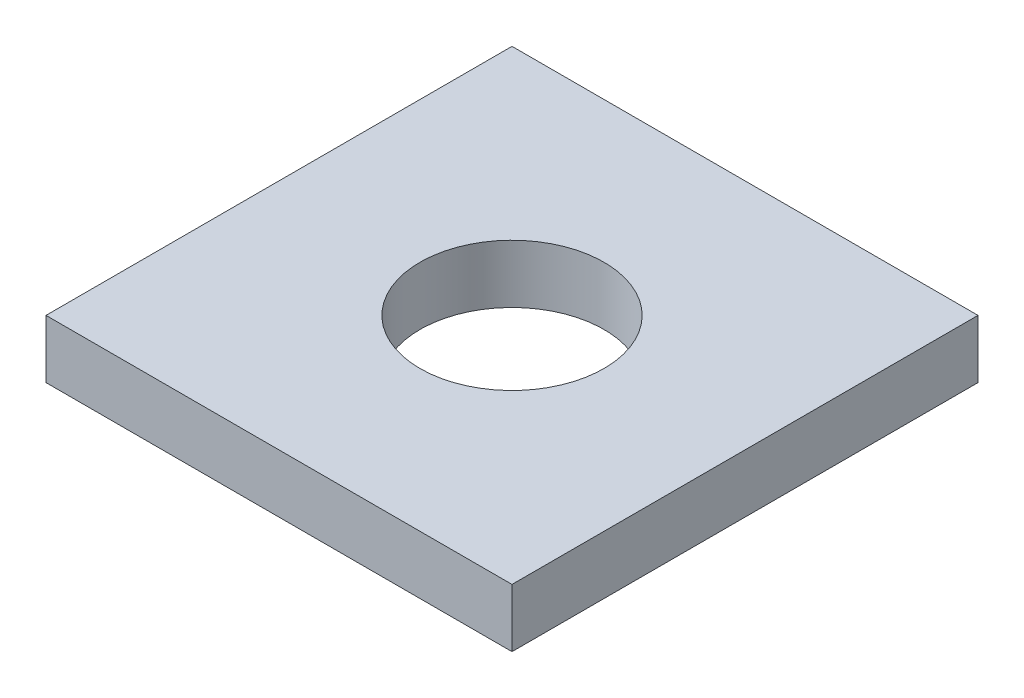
ISO-10303-21;
HEADER;
FILE_DESCRIPTION(('STEP AP214'),'2;1');
FILE_NAME('part.step','',(''),(''),'','','');
FILE_SCHEMA(('AUTOMOTIVE_DESIGN { 1 0 10303 214 1 1 1 1 }'));
ENDSEC;
DATA;
#1=APPLICATION_CONTEXT('core data for automotive mechanical design processes');
#2=APPLICATION_PROTOCOL_DEFINITION('international standard','automotive_design',2000,#1);
#3=PRODUCT_CONTEXT('',#1,'mechanical');
#4=PRODUCT('Part','Part','',(#3));
#5=PRODUCT_RELATED_PRODUCT_CATEGORY('part','',(#4));
#6=PRODUCT_DEFINITION_FORMATION('','',#4);
#7=PRODUCT_DEFINITION_CONTEXT('part definition',#1,'design');
#8=PRODUCT_DEFINITION('design','',#6,#7);
#9=PRODUCT_DEFINITION_SHAPE('','',#8);
#10=(LENGTH_UNIT() NAMED_UNIT(*) SI_UNIT(.MILLI.,.METRE.));
#11=(NAMED_UNIT(*) PLANE_ANGLE_UNIT() SI_UNIT($,.RADIAN.));
#12=(NAMED_UNIT(*) SI_UNIT($,.STERADIAN.) SOLID_ANGLE_UNIT());
#13=UNCERTAINTY_MEASURE_WITH_UNIT(LENGTH_MEASURE(1.E-05),#10,'distance_accuracy_value','');
#14=(GEOMETRIC_REPRESENTATION_CONTEXT(3) GLOBAL_UNCERTAINTY_ASSIGNED_CONTEXT((#13)) GLOBAL_UNIT_ASSIGNED_CONTEXT((#10,
#11,#12)) REPRESENTATION_CONTEXT('',''));
#15=CARTESIAN_POINT('',(0.,0.,0.));
#16=DIRECTION('',(0.,0.,1.));
#17=DIRECTION('',(1.,0.,0.));
#18=AXIS2_PLACEMENT_3D('',#15,#16,#17);
#19=CARTESIAN_POINT('',(-25.4000000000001,6.34999999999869,25.3999999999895));
#20=DIRECTION('',(0.,1.,0.));
#21=DIRECTION('',(0.,0.,1.));
#22=AXIS2_PLACEMENT_3D('',#19,#20,#21);
#23=PLANE('',#22);
#24=DIRECTION('',(0.,0.,1.));
#25=VECTOR('',#24,1.);
#26=CARTESIAN_POINT('',(-25.4000000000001,6.34999999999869,-25.4000000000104));
#27=LINE('',#26,#25);
#28=CARTESIAN_POINT('',(-25.4000000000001,6.34999999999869,-25.4000000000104));
#29=VERTEX_POINT('',#28);
#30=CARTESIAN_POINT('',(-25.4000000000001,6.34999999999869,25.3999999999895));
#31=VERTEX_POINT('',#30);
#32=EDGE_CURVE('E95',#29,#31,#27,.T.);
#33=ORIENTED_EDGE('',*,*,#32,.T.);
#34=DIRECTION('',(1.,0.,0.));
#35=VECTOR('',#34,1.);
#36=CARTESIAN_POINT('',(-25.4000000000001,6.34999999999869,25.3999999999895));
#37=LINE('',#36,#35);
#38=CARTESIAN_POINT('',(25.4000000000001,6.34999999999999,25.4));
#39=VERTEX_POINT('',#38);
#40=EDGE_CURVE('E80',#31,#39,#37,.T.);
#41=ORIENTED_EDGE('',*,*,#40,.T.);
#42=DIRECTION('',(0.,0.,-1.));
#43=VECTOR('',#42,1.);
#44=CARTESIAN_POINT('',(25.4000000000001,6.34999999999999,-25.4));
#45=LINE('',#44,#43);
#46=CARTESIAN_POINT('',(25.4000000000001,6.34999999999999,-25.4));
#47=VERTEX_POINT('',#46);
#48=EDGE_CURVE('E46',#39,#47,#45,.T.);
#49=ORIENTED_EDGE('',*,*,#48,.T.);
#50=DIRECTION('',(-1.,0.,0.));
#51=VECTOR('',#50,1.);
#52=CARTESIAN_POINT('',(-25.4000000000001,6.34999999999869,-25.4000000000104));
#53=LINE('',#52,#51);
#54=EDGE_CURVE('E41',#47,#29,#53,.T.);
#55=ORIENTED_EDGE('',*,*,#54,.T.);
#56=EDGE_LOOP('',(#33,#41,#49,#55));
#57=FACE_BOUND('',#56,.T.);
#58=CARTESIAN_POINT('',(0.,6.34999999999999,0.));
#59=DIRECTION('',(0.,1.,0.));
#60=DIRECTION('',(0.,0.,1.));
#61=AXIS2_PLACEMENT_3D('',#58,#59,#60);
#62=CIRCLE('',#61,10.033);
#63=CARTESIAN_POINT('',(0.,6.34999999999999,10.033));
#64=VERTEX_POINT('',#63);
#65=EDGE_CURVE('E85',#64,#64,#62,.T.);
#66=ORIENTED_EDGE('',*,*,#65,.F.);
#67=EDGE_LOOP('',(#66));
#68=FACE_BOUND('',#67,.T.);
#69=ADVANCED_FACE('F26',(#57,#68),#23,.T.);
#70=CARTESIAN_POINT('',(-25.4000000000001,-1.30451205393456E-12,25.3999999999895));
#71=DIRECTION('',(0.,1.,0.));
#72=DIRECTION('',(0.,0.,1.));
#73=AXIS2_PLACEMENT_3D('',#70,#71,#72);
#74=PLANE('',#73);
#75=DIRECTION('',(0.,0.,1.));
#76=VECTOR('',#75,1.);
#77=CARTESIAN_POINT('',(-25.4000000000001,-1.30451205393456E-12,-25.4000000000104));
#78=LINE('',#77,#76);
#79=CARTESIAN_POINT('',(-25.4000000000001,-1.30451205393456E-12,-25.4000000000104));
#80=VERTEX_POINT('',#79);
#81=CARTESIAN_POINT('',(-25.4000000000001,-1.30451205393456E-12,25.3999999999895));
#82=VERTEX_POINT('',#81);
#83=EDGE_CURVE('E72',#80,#82,#78,.T.);
#84=ORIENTED_EDGE('',*,*,#83,.F.);
#85=DIRECTION('',(-1.,0.,0.));
#86=VECTOR('',#85,1.);
#87=CARTESIAN_POINT('',(-25.4000000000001,-1.30451205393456E-12,-25.4000000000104));
#88=LINE('',#87,#86);
#89=CARTESIAN_POINT('',(25.4000000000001,0.,-25.4));
#90=VERTEX_POINT('',#89);
#91=EDGE_CURVE('E93',#90,#80,#88,.T.);
#92=ORIENTED_EDGE('',*,*,#91,.F.);
#93=DIRECTION('',(0.,0.,-1.));
#94=VECTOR('',#93,1.);
#95=CARTESIAN_POINT('',(25.4000000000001,0.,-25.4));
#96=LINE('',#95,#94);
#97=CARTESIAN_POINT('',(25.4000000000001,0.,25.4));
#98=VERTEX_POINT('',#97);
#99=EDGE_CURVE('E73',#98,#90,#96,.T.);
#100=ORIENTED_EDGE('',*,*,#99,.F.);
#101=DIRECTION('',(1.,0.,0.));
#102=VECTOR('',#101,1.);
#103=CARTESIAN_POINT('',(-25.4000000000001,-1.30451205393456E-12,25.3999999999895));
#104=LINE('',#103,#102);
#105=EDGE_CURVE('E67',#82,#98,#104,.T.);
#106=ORIENTED_EDGE('',*,*,#105,.F.);
#107=EDGE_LOOP('',(#84,#92,#100,#106));
#108=FACE_BOUND('',#107,.T.);
#109=CARTESIAN_POINT('',(0.,0.,0.));
#110=DIRECTION('',(0.,1.,0.));
#111=DIRECTION('',(0.,0.,1.));
#112=AXIS2_PLACEMENT_3D('',#109,#110,#111);
#113=CIRCLE('',#112,10.033);
#114=CARTESIAN_POINT('',(0.,0.,10.033));
#115=VERTEX_POINT('',#114);
#116=EDGE_CURVE('E88',#115,#115,#113,.T.);
#117=ORIENTED_EDGE('',*,*,#116,.T.);
#118=EDGE_LOOP('',(#117));
#119=FACE_BOUND('',#118,.T.);
#120=ADVANCED_FACE('F68',(#108,#119),#74,.F.);
#121=CARTESIAN_POINT('',(-25.4000000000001,6.34999999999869,-25.4000000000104));
#122=DIRECTION('',(1.,0.,0.));
#123=DIRECTION('',(0.,0.,-1.));
#124=AXIS2_PLACEMENT_3D('',#121,#122,#123);
#125=PLANE('',#124);
#126=ORIENTED_EDGE('',*,*,#83,.T.);
#127=DIRECTION('',(0.,-1.,0.));
#128=VECTOR('',#127,1.);
#129=CARTESIAN_POINT('',(-25.4000000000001,6.34999999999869,25.3999999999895));
#130=LINE('',#129,#128);
#131=EDGE_CURVE('E11',#31,#82,#130,.T.);
#132=ORIENTED_EDGE('',*,*,#131,.F.);
#133=ORIENTED_EDGE('',*,*,#32,.F.);
#134=DIRECTION('',(0.,-1.,0.));
#135=VECTOR('',#134,1.);
#136=CARTESIAN_POINT('',(-25.4000000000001,6.34999999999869,-25.4000000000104));
#137=LINE('',#136,#135);
#138=EDGE_CURVE('E84',#29,#80,#137,.T.);
#139=ORIENTED_EDGE('',*,*,#138,.T.);
#140=EDGE_LOOP('',(#126,#132,#133,#139));
#141=FACE_BOUND('',#140,.T.);
#142=ADVANCED_FACE('F28',(#141),#125,.F.);
#143=CARTESIAN_POINT('',(-25.4000000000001,6.34999999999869,25.3999999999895));
#144=DIRECTION('',(0.,0.,-1.));
#145=DIRECTION('',(-1.,0.,0.));
#146=AXIS2_PLACEMENT_3D('',#143,#144,#145);
#147=PLANE('',#146);
#148=ORIENTED_EDGE('',*,*,#105,.T.);
#149=DIRECTION('',(0.,-1.,0.));
#150=VECTOR('',#149,1.);
#151=CARTESIAN_POINT('',(25.4000000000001,6.34999999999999,25.4));
#152=LINE('',#151,#150);
#153=EDGE_CURVE('E34',#39,#98,#152,.T.);
#154=ORIENTED_EDGE('',*,*,#153,.F.);
#155=ORIENTED_EDGE('',*,*,#40,.F.);
#156=ORIENTED_EDGE('',*,*,#131,.T.);
#157=EDGE_LOOP('',(#148,#154,#155,#156));
#158=FACE_BOUND('',#157,.T.);
#159=ADVANCED_FACE('F79',(#158),#147,.F.);
#160=CARTESIAN_POINT('',(25.4000000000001,6.34999999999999,-25.4));
#161=DIRECTION('',(-1.,0.,0.));
#162=DIRECTION('',(0.,0.,1.));
#163=AXIS2_PLACEMENT_3D('',#160,#161,#162);
#164=PLANE('',#163);
#165=ORIENTED_EDGE('',*,*,#99,.T.);
#166=DIRECTION('',(0.,-1.,0.));
#167=VECTOR('',#166,1.);
#168=CARTESIAN_POINT('',(25.4000000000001,6.34999999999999,-25.4));
#169=LINE('',#168,#167);
#170=EDGE_CURVE('E101',#47,#90,#169,.T.);
#171=ORIENTED_EDGE('',*,*,#170,.F.);
#172=ORIENTED_EDGE('',*,*,#48,.F.);
#173=ORIENTED_EDGE('',*,*,#153,.T.);
#174=EDGE_LOOP('',(#165,#171,#172,#173));
#175=FACE_BOUND('',#174,.T.);
#176=ADVANCED_FACE('F104',(#175),#164,.F.);
#177=CARTESIAN_POINT('',(-25.4000000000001,6.34999999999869,-25.4000000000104));
#178=DIRECTION('',(0.,0.,1.));
#179=DIRECTION('',(1.,0.,0.));
#180=AXIS2_PLACEMENT_3D('',#177,#178,#179);
#181=PLANE('',#180);
#182=ORIENTED_EDGE('',*,*,#91,.T.);
#183=ORIENTED_EDGE('',*,*,#138,.F.);
#184=ORIENTED_EDGE('',*,*,#54,.F.);
#185=ORIENTED_EDGE('',*,*,#170,.T.);
#186=EDGE_LOOP('',(#182,#183,#184,#185));
#187=FACE_BOUND('',#186,.T.);
#188=ADVANCED_FACE('F106',(#187),#181,.F.);
#189=CARTESIAN_POINT('',(0.,6.34999999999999,0.));
#190=DIRECTION('',(0.,-1.,0.));
#191=DIRECTION('',(0.,0.,-1.));
#192=AXIS2_PLACEMENT_3D('',#189,#190,#191);
#193=CYLINDRICAL_SURFACE('',#192,10.033);
#194=ORIENTED_EDGE('',*,*,#65,.T.);
#195=EDGE_LOOP('',(#194));
#196=FACE_BOUND('',#195,.T.);
#197=ORIENTED_EDGE('',*,*,#116,.F.);
#198=EDGE_LOOP('',(#197));
#199=FACE_BOUND('',#198,.T.);
#200=ADVANCED_FACE('F112',(#196,#199),#193,.F.);
#201=CLOSED_SHELL('',(#69,#120,#142,#159,#176,#188,#200));
#202=MANIFOLD_SOLID_BREP('B2',#201);
#203=ADVANCED_BREP_SHAPE_REPRESENTATION('',(#18,#202),#14);
#204=SHAPE_DEFINITION_REPRESENTATION(#9,#203);
ENDSEC;
END-ISO-10303-21;
